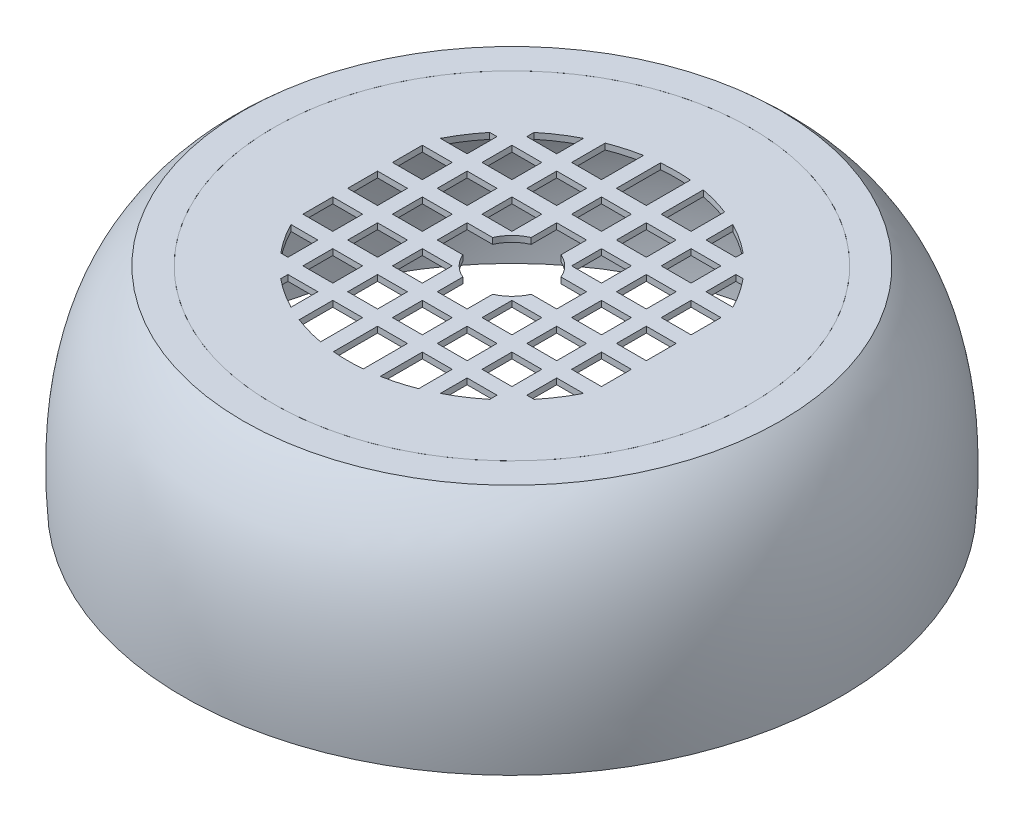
from build123d import *

# Parameters (mm, degrees)
CROQUIS3_R              = 80
SALIENTE_EXTRUIR1_DEPTH = 2
CROQUIS4_R              = 12.5
CORTAR_EXTRUIR1_DEPTH   = 2
CROQUIS5_W              = 10
CROQUIS5_H              = 10
CORTAR_EXTRUIR2_DEPTH   = 2


with BuildPart() as part:
    # Croquis2 → Revoluci_n1 (revolve)
    with BuildSketch(Plane.XY):
        with BuildLine():
            Line((-90, 70), (-80, 70))
            add(Edge.make_bspline(
                [(-100, 0), (-102.826144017, 46.451778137), (-80, 70)],
                knots=[0, 0, 0, 0.542381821, 0.542381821, 0.542381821], degree=2))
            Line((-100, 0), (-110, 0))
            add(Edge.make_bspline(
                [(-110, 0), (-113.371316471, 49.798209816), (-90, 70)],
                knots=[0, 0, 0, 0.517639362, 0.517639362, 0.517639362], degree=2))
        make_face()
    revolve(axis=Axis((0, 0, 0), (0, 1, 0)))


with BuildPart() as body_2:
    # Croquis3 → Saliente-Extruir1 (new body)
    with BuildSketch(Plane(origin=(0, 70, 0), x_dir=(1, 0, 0), z_dir=(0, 1, 0))):
        with Locations(Location((0, 0, 0), (0, 0, 270))):
            Circle(CROQUIS3_R)
    extrude(amount=-SALIENTE_EXTRUIR1_DEPTH)

    # Croquis4 → Cortar-Extruir1 (cut)
    with BuildSketch(Plane(origin=(0, 70, 0), x_dir=(1, 0, 0), z_dir=(0, 1, 0))):
        with Locations(Location((0, 0, 0), (0, 0, 270))):
            Circle(CROQUIS4_R)
    extrude(amount=-CORTAR_EXTRUIR1_DEPTH, mode=Mode.SUBTRACT)

    # Croquis5 → Cortar-Extruir2 (cut)
    with BuildSketch(Plane(origin=(0, 70, 0), x_dir=(1, 0, 0), z_dir=(0, 1, 0))):
        with BuildLine():
            Line((-10, -40), (-20, -40))
            Line((-20, -40), (-20, -51.23475383))
            ThreePointArc((-20, -51.23475383), (-15.067465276, -52.895855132), (-10, -54.083269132))
            Line((-10, -54.083269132), (-10, -40))
        make_face()
        with BuildLine():
            Line((-40, 25), (-40, 35))
            Line((-40, 35), (-42.426406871, 35))
            ThreePointArc((-42.426406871, 35), (-45.980762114, 30.178958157), (-48.989794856, 25))
            Line((-48.989794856, 25), (-40, 25))
        make_face()
        with BuildLine():
            Line((-25, 40), (-25, 48.989794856))
            ThreePointArc((-25, 48.989794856), (-30.178958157, 45.980762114), (-35, 42.426406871))
            Line((-35, 42.426406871), (-35, 40))
            Line((-35, 40), (-25, 40))
        make_face()
        with BuildLine():
            Line((-10, 40), (-10, 54.083269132))
            ThreePointArc((-10, 54.083269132), (-15.067465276, 52.895855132), (-20, 51.23475383))
            Line((-20, 51.23475383), (-20, 40))
            Line((-20, 40), (-10, 40))
        make_face()
        with BuildLine():
            Line((-25, -48.989794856), (-25, -40))
            Line((-25, -40), (-35, -40))
            Line((-35, -40), (-35, -42.426406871))
            ThreePointArc((-35, -42.426406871), (-30.178958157, -45.980762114), (-25, -48.989794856))
        make_face()
        with Locations((-30, -30)):
            Rectangle(CROQUIS5_W, CROQUIS5_H)
        with BuildLine():
            Line((5, 40), (5, 54.772255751))
            ThreePointArc((5, 54.772255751), (0, 55), (-5, 54.772255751))
            Line((-5, 54.772255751), (-5, 40))
            Line((-5, 40), (5, 40))
        make_face()
        with BuildLine():
            Line((20, 40), (20, 51.23475383))
            ThreePointArc((20, 51.23475383), (15.067465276, 52.895855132), (10, 54.083269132))
            Line((10, 54.083269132), (10, 40))
            Line((10, 40), (20, 40))
        make_face()
        with Locations((-15, -30)):
            Rectangle(CROQUIS5_W, CROQUIS5_H)
        with Locations((-30, -15)):
            Rectangle(CROQUIS5_W, CROQUIS5_H)
        with Locations((45, -15)):
            Rectangle(CROQUIS5_W, CROQUIS5_H)
        with Locations((45, 0)):
            Rectangle(CROQUIS5_W, CROQUIS5_H)
        with Locations((45, 15)):
            Rectangle(CROQUIS5_W, CROQUIS5_H)
        with Locations((-15, -15)):
            Rectangle(CROQUIS5_W, CROQUIS5_H)
        with Locations((-30, 0)):
            Rectangle(CROQUIS5_W, CROQUIS5_H)
        with BuildLine():
            Line((-20, -5), (-11.398395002, -5))
            ThreePointArc((-11.398395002, -5), (-12.446823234, 0), (-11.398395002, 5))
            Line((-11.398395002, 5), (-20, 5))
            Line((-20, 5), (-20, -5))
        make_face()
        with BuildLine():
            Line((20, -40), (10, -40))
            Line((10, -40), (10, -54.083269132))
            ThreePointArc((10, -54.083269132), (15.067465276, -52.895855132), (20, -51.23475383))
            Line((20, -51.23475383), (20, -40))
        make_face()
        with Locations((-45, 15)):
            Rectangle(CROQUIS5_W, CROQUIS5_H)
        with Locations((-30, 15)):
            Rectangle(CROQUIS5_W, CROQUIS5_H)
        with Locations((-15, 15)):
            Rectangle(CROQUIS5_W, CROQUIS5_H)
        with Locations((-30, 30)):
            Rectangle(CROQUIS5_W, CROQUIS5_H)
        with Locations((-15, 30)):
            Rectangle(CROQUIS5_W, CROQUIS5_H)
        with Locations((15, -30)):
            Rectangle(CROQUIS5_W, CROQUIS5_H)
        with BuildLine():
            Line((35, -42.426406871), (35, -40))
            Line((35, -40), (25, -40))
            Line((25, -40), (25, -48.989794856))
            ThreePointArc((25, -48.989794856), (30.178958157, -45.980762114), (35, -42.426406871))
        make_face()
        with BuildLine():
            Line((40, -35), (42.426406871, -35))
            ThreePointArc((42.426406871, -35), (45.980762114, -30.178958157), (48.989794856, -25))
            Line((48.989794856, -25), (40, -25))
            Line((40, -25), (40, -35))
        make_face()
        with BuildLine():
            Line((40, 25), (48.989794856, 25))
            ThreePointArc((48.989794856, 25), (45.980762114, 30.178958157), (42.426406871, 35))
            Line((42.426406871, 35), (40, 35))
            Line((40, 35), (40, 25))
        make_face()
        with BuildLine():
            Line((25, 40), (35, 40))
            Line((35, 40), (35, 42.426406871))
            ThreePointArc((35, 42.426406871), (30.178958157, 45.980762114), (25, 48.989794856))
            Line((25, 48.989794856), (25, 40))
        make_face()
        with BuildLine():
            Line((5, -54.772255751), (5, -40))
            Line((5, -40), (-5, -40))
            Line((-5, -40), (-5, -54.772255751))
            ThreePointArc((-5, -54.772255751), (0, -55), (5, -54.772255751))
        make_face()
        with Locations((0, -30)):
            Rectangle(CROQUIS5_W, CROQUIS5_H)
        with BuildLine():
            Line((-5, -20), (5, -20))
            Line((5, -20), (5, -11.398395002))
            ThreePointArc((5, -11.398395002), (0, -12.446823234), (-5, -11.398395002))
            Line((-5, -11.398395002), (-5, -20))
        make_face()
        with BuildLine():
            Line((5, 11.398395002), (5, 20))
            Line((5, 20), (-5, 20))
            Line((-5, 20), (-5, 11.398395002))
            ThreePointArc((-5, 11.398395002), (0, 12.446823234), (5, 11.398395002))
        make_face()
        with Locations((0, 30)):
            Rectangle(CROQUIS5_W, CROQUIS5_H)
        with Locations((15, -15)):
            Rectangle(CROQUIS5_W, CROQUIS5_H)
        with BuildLine():
            Line((11.398395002, -5), (20, -5))
            Line((20, -5), (20, 5))
            Line((20, 5), (11.398395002, 5))
            ThreePointArc((11.398395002, 5), (12.446823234, 0), (11.398395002, -5))
        make_face()
        with Locations((15, 15)):
            Rectangle(CROQUIS5_W, CROQUIS5_H)
        with Locations((15, 30)):
            Rectangle(CROQUIS5_W, CROQUIS5_H)
        with Locations((30, -30)):
            Rectangle(CROQUIS5_W, CROQUIS5_H)
        with Locations((30, -15)):
            Rectangle(CROQUIS5_W, CROQUIS5_H)
        with Locations((30, 0)):
            Rectangle(CROQUIS5_W, CROQUIS5_H)
        with Locations((30, 15)):
            Rectangle(CROQUIS5_W, CROQUIS5_H)
        with Locations((30, 30)):
            Rectangle(CROQUIS5_W, CROQUIS5_H)
        with BuildLine():
            Line((-42.426406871, -35), (-40, -35))
            Line((-40, -35), (-40, -25))
            Line((-40, -25), (-48.989794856, -25))
            ThreePointArc((-48.989794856, -25), (-45.980762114, -30.178958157), (-42.426406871, -35))
        make_face()
        with Locations((-45, -15)):
            Rectangle(CROQUIS5_W, CROQUIS5_H)
        with Locations((-45, 0)):
            Rectangle(CROQUIS5_W, CROQUIS5_H)
    extrude(amount=-CORTAR_EXTRUIR2_DEPTH, mode=Mode.SUBTRACT)


solid = Compound([part.part, body_2.part])
